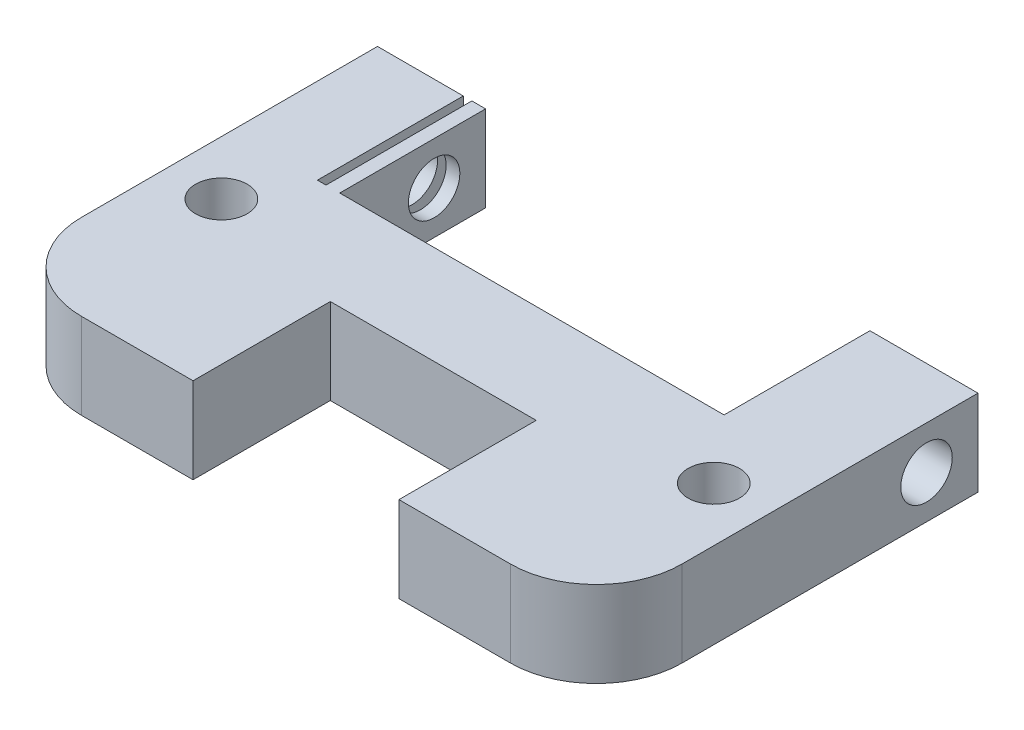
from build123d import *

# Parameters (mm, degrees)
SKIZZE1_R                       = 1.5
AUFSATZ_LINEAR_AUSTRAGEN4_DEPTH = 5
SKIZZE3_R                       = 1.5
SCHNITT_LINEAR_AUSTRAGEN2_DEPTH = 42.773945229
VERRUNDUNG1_R                   = 5


with BuildPart() as part:
    # Skizze1 → Aufsatz-Linear austragen4 (new body)
    with BuildSketch(Plane(origin=(0, 0, 0), x_dir=(1, 0, 0), z_dir=(0, 1, 0))):
        Polygon((11.2, 0), (17.5, 0), (17.5, -22.25), (6, -22.25), (6, -14.25), (-6, -14.25), (-6, -22.25), (-17.5, -22.25), (-17.5, 0), (-12.5, 0), (-12.5, -8.5), (-12, -8.5), (-12, 0), (-11.2, 0), (-11.2, -8.5), (11.2, -8.5), align=None)
        with Locations(Location((14.35, -12.25, 0), (0, 0, 270))):
            Circle(SKIZZE1_R, mode=Mode.SUBTRACT)
        with Locations(Location((-14.35, -12.25, 0), (0, 0, 90))):
            Circle(SKIZZE1_R, mode=Mode.SUBTRACT)
    extrude(amount=AUFSATZ_LINEAR_AUSTRAGEN4_DEPTH)

    # Skizze3 → Schnitt-Linear austragen2 (cut, through all)
    with BuildSketch(Plane(origin=(17.5, 0, 0), x_dir=(0, 0, -1), z_dir=(1, 0, 0))):
        with Locations((-3, 2.5)):
            Circle(SKIZZE3_R)
    extrude(amount=-SCHNITT_LINEAR_AUSTRAGEN2_DEPTH, mode=Mode.SUBTRACT)

    # Verrundung1
    verrundung1_edges = [part.edges().sort_by_distance(p)[0] for p in [
        (17.5, 2.5, 22.25),
        (-17.5, 2.5, 22.25),
    ]]
    fillet(verrundung1_edges, radius=VERRUNDUNG1_R)


solid = part.part
